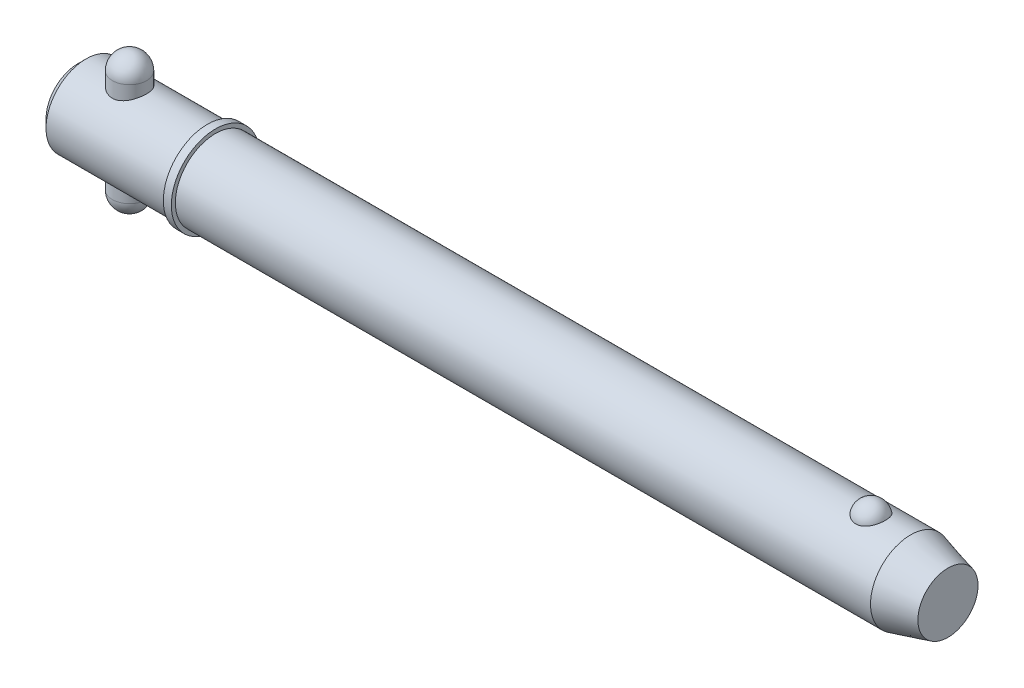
ISO-10303-21;
HEADER;
FILE_DESCRIPTION(('STEP AP214'),'2;1');
FILE_NAME('part.step','',(''),(''),'','','');
FILE_SCHEMA(('AUTOMOTIVE_DESIGN { 1 0 10303 214 1 1 1 1 }'));
ENDSEC;
DATA;
#1=APPLICATION_CONTEXT('core data for automotive mechanical design processes');
#2=APPLICATION_PROTOCOL_DEFINITION('international standard','automotive_design',2000,#1);
#3=PRODUCT_CONTEXT('',#1,'mechanical');
#4=PRODUCT('Part','Part','',(#3));
#5=PRODUCT_RELATED_PRODUCT_CATEGORY('part','',(#4));
#6=PRODUCT_DEFINITION_FORMATION('','',#4);
#7=PRODUCT_DEFINITION_CONTEXT('part definition',#1,'design');
#8=PRODUCT_DEFINITION('design','',#6,#7);
#9=PRODUCT_DEFINITION_SHAPE('','',#8);
#10=(LENGTH_UNIT() NAMED_UNIT(*) SI_UNIT(.MILLI.,.METRE.));
#11=(NAMED_UNIT(*) PLANE_ANGLE_UNIT() SI_UNIT($,.RADIAN.));
#12=(NAMED_UNIT(*) SI_UNIT($,.STERADIAN.) SOLID_ANGLE_UNIT());
#13=UNCERTAINTY_MEASURE_WITH_UNIT(LENGTH_MEASURE(1.E-05),#10,'distance_accuracy_value','');
#14=(GEOMETRIC_REPRESENTATION_CONTEXT(3) GLOBAL_UNCERTAINTY_ASSIGNED_CONTEXT((#13)) GLOBAL_UNIT_ASSIGNED_CONTEXT((#10,
#11,#12)) REPRESENTATION_CONTEXT('',''));
#15=CARTESIAN_POINT('',(0.,0.,0.));
#16=DIRECTION('',(0.,0.,1.));
#17=DIRECTION('',(1.,0.,0.));
#18=AXIS2_PLACEMENT_3D('',#15,#16,#17);
#19=CARTESIAN_POINT('',(14.28,19.05,0.));
#20=DIRECTION('',(0.,-1.,0.));
#21=DIRECTION('',(0.,0.,-1.));
#22=AXIS2_PLACEMENT_3D('',#19,#20,#21);
#23=CYLINDRICAL_SURFACE('',#22,4.76);
#24=CARTESIAN_POINT('',(14.28,-14.29,0.));
#25=DIRECTION('',(0.,-1.,0.));
#26=DIRECTION('',(0.,0.,-1.));
#27=AXIS2_PLACEMENT_3D('',#24,#25,#26);
#28=CIRCLE('',#27,4.76);
#29=CARTESIAN_POINT('',(14.28,-14.29,-4.76));
#30=VERTEX_POINT('',#29);
#31=EDGE_CURVE('P0_E10',#30,#30,#28,.F.);
#32=CARTESIAN_POINT('',(14.28,14.29,0.));
#33=DIRECTION('',(0.,-1.,0.));
#34=DIRECTION('',(0.,0.,-1.));
#35=AXIS2_PLACEMENT_3D('',#32,#33,#34);
#36=CIRCLE('',#35,4.76);
#37=CARTESIAN_POINT('',(14.28,14.29,-4.76));
#38=VERTEX_POINT('',#37);
#39=EDGE_CURVE('P0_E21',#38,#38,#36,.T.);
#40=CARTESIAN_POINT('',(14.28,-14.29,-4.76));
#41=CARTESIAN_POINT('',(14.28,-13.9922916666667,-4.76));
#42=CARTESIAN_POINT('',(14.28,-13.6945833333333,-4.76));
#43=CARTESIAN_POINT('',(14.28,-13.0991666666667,-4.76));
#44=CARTESIAN_POINT('',(14.28,-12.8014583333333,-4.76));
#45=CARTESIAN_POINT('',(14.28,-12.2060416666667,-4.76));
#46=CARTESIAN_POINT('',(14.28,-11.9083333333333,-4.76));
#47=CARTESIAN_POINT('',(14.28,-11.3129166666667,-4.76));
#48=CARTESIAN_POINT('',(14.28,-11.0152083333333,-4.76));
#49=CARTESIAN_POINT('',(14.28,-10.4197916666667,-4.76));
#50=CARTESIAN_POINT('',(14.28,-10.1220833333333,-4.76));
#51=CARTESIAN_POINT('',(14.28,-9.52666666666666,-4.76));
#52=CARTESIAN_POINT('',(14.28,-9.22895833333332,-4.76));
#53=CARTESIAN_POINT('',(14.28,-8.63354166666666,-4.76));
#54=CARTESIAN_POINT('',(14.28,-8.33583333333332,-4.76));
#55=CARTESIAN_POINT('',(14.28,-7.74041666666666,-4.76));
#56=CARTESIAN_POINT('',(14.28,-7.44270833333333,-4.76));
#57=CARTESIAN_POINT('',(14.28,-6.84729166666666,-4.76));
#58=CARTESIAN_POINT('',(14.28,-6.54958333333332,-4.76));
#59=CARTESIAN_POINT('',(14.28,-5.95416666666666,-4.76));
#60=CARTESIAN_POINT('',(14.28,-5.65645833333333,-4.76));
#61=CARTESIAN_POINT('',(14.28,-5.06104166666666,-4.76));
#62=CARTESIAN_POINT('',(14.28,-4.76333333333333,-4.76));
#63=CARTESIAN_POINT('',(14.28,-4.16791666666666,-4.76));
#64=CARTESIAN_POINT('',(14.28,-3.87020833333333,-4.76));
#65=CARTESIAN_POINT('',(14.28,-3.27479166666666,-4.76));
#66=CARTESIAN_POINT('',(14.28,-2.97708333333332,-4.76));
#67=CARTESIAN_POINT('',(14.28,-2.38166666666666,-4.76));
#68=CARTESIAN_POINT('',(14.28,-2.08395833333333,-4.76));
#69=CARTESIAN_POINT('',(14.28,-1.48854166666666,-4.76));
#70=CARTESIAN_POINT('',(14.28,-1.19083333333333,-4.76));
#71=CARTESIAN_POINT('',(14.28,-0.595416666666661,-4.76));
#72=CARTESIAN_POINT('',(14.28,-0.297708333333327,-4.76));
#73=CARTESIAN_POINT('',(14.28,0.297708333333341,-4.76));
#74=CARTESIAN_POINT('',(14.28,0.595416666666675,-4.76));
#75=CARTESIAN_POINT('',(14.28,1.19083333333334,-4.76));
#76=CARTESIAN_POINT('',(14.28,1.48854166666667,-4.76));
#77=CARTESIAN_POINT('',(14.28,2.08395833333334,-4.76));
#78=CARTESIAN_POINT('',(14.28,2.38166666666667,-4.76));
#79=CARTESIAN_POINT('',(14.28,2.97708333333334,-4.76));
#80=CARTESIAN_POINT('',(14.28,3.27479166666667,-4.76));
#81=CARTESIAN_POINT('',(14.28,3.87020833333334,-4.76));
#82=CARTESIAN_POINT('',(14.28,4.16791666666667,-4.76));
#83=CARTESIAN_POINT('',(14.28,4.76333333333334,-4.76));
#84=CARTESIAN_POINT('',(14.28,5.06104166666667,-4.76));
#85=CARTESIAN_POINT('',(14.28,5.65645833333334,-4.76));
#86=CARTESIAN_POINT('',(14.28,5.95416666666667,-4.76));
#87=CARTESIAN_POINT('',(14.28,6.54958333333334,-4.76));
#88=CARTESIAN_POINT('',(14.28,6.84729166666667,-4.76));
#89=CARTESIAN_POINT('',(14.28,7.44270833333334,-4.76));
#90=CARTESIAN_POINT('',(14.28,7.74041666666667,-4.76));
#91=CARTESIAN_POINT('',(14.28,8.33583333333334,-4.76));
#92=CARTESIAN_POINT('',(14.28,8.63354166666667,-4.76));
#93=CARTESIAN_POINT('',(14.28,9.22895833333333,-4.76));
#94=CARTESIAN_POINT('',(14.28,9.52666666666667,-4.76));
#95=CARTESIAN_POINT('',(14.28,10.1220833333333,-4.76));
#96=CARTESIAN_POINT('',(14.28,10.4197916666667,-4.76));
#97=CARTESIAN_POINT('',(14.28,11.0152083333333,-4.76));
#98=CARTESIAN_POINT('',(14.28,11.3129166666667,-4.76));
#99=CARTESIAN_POINT('',(14.28,11.9083333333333,-4.76));
#100=CARTESIAN_POINT('',(14.28,12.2060416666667,-4.76));
#101=CARTESIAN_POINT('',(14.28,12.8014583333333,-4.76));
#102=CARTESIAN_POINT('',(14.28,13.0991666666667,-4.76));
#103=CARTESIAN_POINT('',(14.28,13.6945833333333,-4.76));
#104=CARTESIAN_POINT('',(14.28,13.9922916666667,-4.76));
#105=CARTESIAN_POINT('',(14.28,14.29,-4.76));
#106=B_SPLINE_CURVE_WITH_KNOTS('',3,(#40,#41,#42,#43,#44,#45,#46,#47,#48,#49,#50,#51,#52,#53,
#54,#55,#56,#57,#58,#59,#60,#61,#62,#63,#64,#65,#66,#67,#68,#69,#70,#71,#72,#73,#74,#75,#76,#77,
#78,#79,#80,#81,#82,#83,#84,#85,#86,#87,#88,#89,#90,#91,#92,#93,#94,#95,#96,#97,#98,#99,#100,
#101,#102,#103,#104,#105),.UNSPECIFIED.,.F.,.F.,(4,2,2,2,2,2,2,2,2,2,2,2,2,2,2,2,2,2,2,2,2,2,2,
2,2,2,2,2,2,2,2,2,4),(0.,0.893125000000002,1.78625,2.67937499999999,3.5725,4.465625,5.35875,
6.25187499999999,7.145,8.038125,8.93125,9.82437499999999,10.7175,11.610625,12.50375,13.396875,
14.29,15.183125,16.07625,16.969375,17.8625,18.755625,19.64875,20.541875,21.435,22.328125,
23.22125,24.114375,25.0075,25.900625,26.79375,27.686875,28.58),.UNSPECIFIED.);
#107=EDGE_CURVE('P0_BSEAM14',#30,#38,#106,.T.);
#108=ORIENTED_EDGE('',*,*,#31,.T.);
#109=ORIENTED_EDGE('',*,*,#39,.T.);
#110=ORIENTED_EDGE('',*,*,#107,.T.);
#111=ORIENTED_EDGE('',*,*,#107,.F.);
#112=EDGE_LOOP('',(#108,#110,#109,#111));
#113=FACE_BOUND('',#112,.T.);
#114=ADVANCED_FACE('P0_F14',(#113),#23,.T.);
#115=CARTESIAN_POINT('',(14.28,-14.29,0.));
#116=DIRECTION('',(0.,0.,1.));
#117=DIRECTION('',(1.,0.,0.));
#118=AXIS2_PLACEMENT_3D('',#115,#116,#117);
#119=SPHERICAL_SURFACE('',#118,4.76);
#120=CARTESIAN_POINT('',(14.28,-14.29,0.));
#121=DIRECTION('',(0.,-1.,0.));
#122=DIRECTION('',(0.,0.,-1.));
#123=AXIS2_PLACEMENT_3D('',#120,#121,#122);
#124=SPHERICAL_SURFACE('',#123,4.76);
#125=ORIENTED_EDGE('',*,*,#31,.F.);
#126=EDGE_LOOP('',(#125));
#127=FACE_BOUND('',#126,.T.);
#128=ADVANCED_FACE('P0_F29',(#127),#124,.T.);
#129=CARTESIAN_POINT('',(14.28,14.29,0.));
#130=DIRECTION('',(0.,0.,1.));
#131=DIRECTION('',(1.,0.,0.));
#132=AXIS2_PLACEMENT_3D('',#129,#130,#131);
#133=SPHERICAL_SURFACE('',#132,4.76);
#134=CARTESIAN_POINT('',(14.28,14.29,0.));
#135=DIRECTION('',(0.,-1.,0.));
#136=DIRECTION('',(0.,0.,-1.));
#137=AXIS2_PLACEMENT_3D('',#134,#135,#136);
#138=SPHERICAL_SURFACE('',#137,4.76);
#139=ORIENTED_EDGE('',*,*,#39,.F.);
#140=EDGE_LOOP('',(#139));
#141=FACE_BOUND('',#140,.T.);
#142=ADVANCED_FACE('P0_F16',(#141),#138,.T.);
#143=CLOSED_SHELL('',(#114,#128,#142));
#144=MANIFOLD_SOLID_BREP('P0_B1',#143);
#145=CARTESIAN_POINT('',(0.,0.,0.));
#146=DIRECTION('',(1.,0.,0.));
#147=DIRECTION('',(0.,0.,-1.));
#148=AXIS2_PLACEMENT_3D('',#145,#146,#147);
#149=CYLINDRICAL_SURFACE('',#148,11.115);
#150=CARTESIAN_POINT('',(230.929563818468,0.,0.));
#151=DIRECTION('',(1.,0.,0.));
#152=DIRECTION('',(0.,0.,-1.));
#153=AXIS2_PLACEMENT_3D('',#150,#151,#152);
#154=CIRCLE('',#153,11.115);
#155=CARTESIAN_POINT('',(230.929563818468,0.,-11.115));
#156=VERTEX_POINT('',#155);
#157=EDGE_CURVE('P1_E81',#156,#156,#154,.T.);
#158=ORIENTED_EDGE('',*,*,#157,.F.);
#159=EDGE_LOOP('',(#158));
#160=FACE_BOUND('',#159,.T.);
#161=CARTESIAN_POINT('',(38.1,0.,0.));
#162=DIRECTION('',(1.,0.,0.));
#163=DIRECTION('',(0.,0.,-1.));
#164=AXIS2_PLACEMENT_3D('',#161,#162,#163);
#165=CIRCLE('',#164,11.115);
#166=CARTESIAN_POINT('',(38.1,0.,-11.115));
#167=VERTEX_POINT('',#166);
#168=EDGE_CURVE('P1_E85',#167,#167,#165,.T.);
#169=ORIENTED_EDGE('',*,*,#168,.T.);
#170=EDGE_LOOP('',(#169));
#171=FACE_BOUND('',#170,.T.);
#172=CARTESIAN_POINT('',(219.931068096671,10.3028087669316,4.17077409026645));
#173=CARTESIAN_POINT('',(219.714775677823,10.3028003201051,4.17078240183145));
#174=CARTESIAN_POINT('',(219.498548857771,10.3098895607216,4.15340593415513));
#175=CARTESIAN_POINT('',(219.072540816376,10.3373834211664,4.08449540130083));
#176=CARTESIAN_POINT('',(218.862757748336,10.3577841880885,4.0329712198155));
#177=CARTESIAN_POINT('',(218.455782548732,10.4095237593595,3.89746513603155));
#178=CARTESIAN_POINT('',(218.258572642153,10.4408466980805,3.81353029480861));
#179=CARTESIAN_POINT('',(217.881338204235,10.5110236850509,3.61560339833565));
#180=CARTESIAN_POINT('',(217.701317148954,10.5498792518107,3.50160528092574));
#181=CARTESIAN_POINT('',(217.357684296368,10.6322884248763,3.24292464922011));
#182=CARTESIAN_POINT('',(217.194686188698,10.6759443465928,3.09746040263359));
#183=CARTESIAN_POINT('',(216.894591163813,10.7625291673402,2.7817192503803));
#184=CARTESIAN_POINT('',(216.757499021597,10.8054579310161,2.61143778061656));
#185=CARTESIAN_POINT('',(216.506408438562,10.8881935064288,2.24226695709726));
#186=CARTESIAN_POINT('',(216.393710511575,10.9277761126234,2.04244123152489));
#187=CARTESIAN_POINT('',(216.201777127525,10.997484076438,1.62578254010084));
#188=CARTESIAN_POINT('',(216.122544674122,11.0276085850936,1.40894804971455));
#189=CARTESIAN_POINT('',(215.998303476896,11.0756732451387,0.961250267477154));
#190=CARTESIAN_POINT('',(215.953760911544,11.0934470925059,0.730239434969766));
#191=CARTESIAN_POINT('',(215.901569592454,11.1143331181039,0.263439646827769));
#192=CARTESIAN_POINT('',(215.893920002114,11.1174456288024,0.0276507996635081));
#193=CARTESIAN_POINT('',(215.91561056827,11.1087161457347,-0.440729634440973));
#194=CARTESIAN_POINT('',(215.944762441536,11.0969502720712,-0.6733313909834));
#195=CARTESIAN_POINT('',(216.039143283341,11.0597872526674,-1.12996621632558));
#196=CARTESIAN_POINT('',(216.104372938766,11.0343898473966,-1.35399912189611));
#197=CARTESIAN_POINT('',(216.26969844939,10.972515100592,-1.78750286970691));
#198=CARTESIAN_POINT('',(216.36983863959,10.9360236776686,-1.99695478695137));
#199=CARTESIAN_POINT('',(216.602940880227,10.8557595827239,-2.39520667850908));
#200=CARTESIAN_POINT('',(216.735905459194,10.8119863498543,-2.58400506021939));
#201=CARTESIAN_POINT('',(217.032407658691,10.7216733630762,-2.93635726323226));
#202=CARTESIAN_POINT('',(217.196056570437,10.675123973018,-3.09981510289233));
#203=CARTESIAN_POINT('',(217.549860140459,10.5846571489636,-3.39592247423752));
#204=CARTESIAN_POINT('',(217.740012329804,10.5407394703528,-3.52857487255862));
#205=CARTESIAN_POINT('',(218.13750141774,10.4616690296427,-3.75646057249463));
#206=CARTESIAN_POINT('',(218.34436705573,10.4263443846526,-3.85245432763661));
#207=CARTESIAN_POINT('',(218.772954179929,10.3675574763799,-4.00798747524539));
#208=CARTESIAN_POINT('',(218.994670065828,10.344090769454,-4.0675405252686));
#209=CARTESIAN_POINT('',(219.434669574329,10.3128282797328,-4.14614314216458));
#210=CARTESIAN_POINT('',(219.652565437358,10.3043040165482,-4.1670783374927));
#211=CARTESIAN_POINT('',(220.08894951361,10.3016771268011,-4.17357158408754));
#212=CARTESIAN_POINT('',(220.307437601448,10.3075716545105,-4.15913661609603));
#213=CARTESIAN_POINT('',(220.731744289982,10.3326686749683,-4.09636961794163));
#214=CARTESIAN_POINT('',(220.937745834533,10.3514555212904,-4.0490957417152));
#215=CARTESIAN_POINT('',(221.338576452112,10.399818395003,-3.92320197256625));
#216=CARTESIAN_POINT('',(221.5334046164,10.4293952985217,-3.84457953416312));
#217=CARTESIAN_POINT('',(221.911191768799,10.4969600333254,-3.65612410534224));
#218=CARTESIAN_POINT('',(222.093797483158,10.5351178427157,-3.54564545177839));
#219=CARTESIAN_POINT('',(222.438204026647,10.6154999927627,-3.29718036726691));
#220=CARTESIAN_POINT('',(222.600000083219,10.657725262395,-3.15918764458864));
#221=CARTESIAN_POINT('',(222.906959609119,10.744212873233,-2.85163580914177));
#222=CARTESIAN_POINT('',(223.050891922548,10.7884718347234,-2.68084605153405));
#223=CARTESIAN_POINT('',(223.309237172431,10.872374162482,-2.31721864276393));
#224=CARTESIAN_POINT('',(223.423644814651,10.9120167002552,-2.12437704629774));
#225=CARTESIAN_POINT('',(223.623873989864,10.9838919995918,-1.71516999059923));
#226=CARTESIAN_POINT('',(223.70866178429,11.0158465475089,-1.49824866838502));
#227=CARTESIAN_POINT('',(223.84268382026,11.0673523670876,-1.05228572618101));
#228=CARTESIAN_POINT('',(223.891917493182,11.086903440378,-0.823243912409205));
#229=CARTESIAN_POINT('',(223.953891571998,11.1116323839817,-0.359087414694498));
#230=CARTESIAN_POINT('',(223.966566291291,11.1167843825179,-0.12396256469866));
#231=CARTESIAN_POINT('',(223.954973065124,11.1121144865,0.345220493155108));
#232=CARTESIAN_POINT('',(223.930705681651,11.1022928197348,0.579278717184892));
#233=CARTESIAN_POINT('',(223.845907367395,11.0687504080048,1.03866534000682));
#234=CARTESIAN_POINT('',(223.785529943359,11.0450885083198,1.26402641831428));
#235=CARTESIAN_POINT('',(223.629853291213,10.9863185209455,1.70076772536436));
#236=CARTESIAN_POINT('',(223.534551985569,10.9512097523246,1.91214712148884));
#237=CARTESIAN_POINT('',(223.310397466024,10.8729733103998,2.316083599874));
#238=CARTESIAN_POINT('',(223.181380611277,10.8298068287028,2.50854240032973));
#239=CARTESIAN_POINT('',(222.892732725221,10.7401896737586,2.86808766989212));
#240=CARTESIAN_POINT('',(222.733102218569,10.6937390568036,3.03517457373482));
#241=CARTESIAN_POINT('',(222.387534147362,10.6029321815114,3.33857581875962));
#242=CARTESIAN_POINT('',(222.201708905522,10.5585680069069,3.47501541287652));
#243=CARTESIAN_POINT('',(221.807875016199,10.4769321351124,3.71390897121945));
#244=CARTESIAN_POINT('',(221.599863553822,10.439661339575,3.81635861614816));
#245=CARTESIAN_POINT('',(221.154066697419,10.3749407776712,3.98910631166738));
#246=CARTESIAN_POINT('',(220.915234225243,10.3482457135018,4.05700929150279));
#247=CARTESIAN_POINT('',(220.427925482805,10.312188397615,4.14782844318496));
#248=CARTESIAN_POINT('',(220.179453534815,10.3028184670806,4.17076454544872));
#249=CARTESIAN_POINT('',(219.931068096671,10.3028087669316,4.17077409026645));
#250=B_SPLINE_CURVE_WITH_KNOTS('',3,(#172,#173,#174,#175,#176,#177,#178,#179,#180,#181,#182,
#183,#184,#185,#186,#187,#188,#189,#190,#191,#192,#193,#194,#195,#196,#197,#198,#199,#200,#201,
#202,#203,#204,#205,#206,#207,#208,#209,#210,#211,#212,#213,#214,#215,#216,#217,#218,#219,#220,
#221,#222,#223,#224,#225,#226,#227,#228,#229,#230,#231,#232,#233,#234,#235,#236,#237,#238,#239,
#240,#241,#242,#243,#244,#245,#246,#247,#248,#249),.UNSPECIFIED.,.T.,.F.,(4,2,2,2,2,2,2,2,2,2,2,
2,2,2,2,2,2,2,2,2,2,2,2,2,2,2,2,2,2,2,2,2,2,2,2,2,2,2,4),(0.,0.64796614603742,1.29574482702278,
1.94258643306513,2.58955857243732,3.25496465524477,3.92049326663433,4.61566368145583,
5.31089647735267,6.01531821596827,6.71972398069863,7.42054043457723,8.12137023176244,
8.82309331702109,9.52487047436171,10.2292439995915,10.9335519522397,11.6223330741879,
12.3108558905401,12.9647664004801,13.6185478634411,14.252184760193,14.8858731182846,
15.5334360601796,16.1811472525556,16.8611459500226,17.5412664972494,18.2431855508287,
18.9451158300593,19.6483065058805,20.3514864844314,21.0516982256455,21.7519516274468,
22.4556690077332,23.1593743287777,23.860149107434,24.5610129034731,25.3054529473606,
26.049562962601),.UNSPECIFIED.);
#251=CARTESIAN_POINT('',(219.931068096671,10.3028087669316,4.17077409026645));
#252=VERTEX_POINT('',#251);
#253=EDGE_CURVE('P1_E35',#252,#252,#250,.T.);
#254=ORIENTED_EDGE('',*,*,#253,.T.);
#255=EDGE_LOOP('',(#254));
#256=FACE_BOUND('',#255,.T.);
#257=ADVANCED_FACE('P1_F13',(#160,#171,#256),#149,.T.);
#258=CARTESIAN_POINT('',(0.,0.,0.));
#259=DIRECTION('',(-1.,0.,0.));
#260=DIRECTION('',(0.,0.,1.));
#261=AXIS2_PLACEMENT_3D('',#258,#259,#260);
#262=PLANE('',#261);
#263=CARTESIAN_POINT('',(0.,0.,0.));
#264=DIRECTION('',(1.,0.,0.));
#265=DIRECTION('',(0.,0.,-1.));
#266=AXIS2_PLACEMENT_3D('',#263,#264,#265);
#267=CIRCLE('',#266,8.892);
#268=CARTESIAN_POINT('',(0.,0.,-8.892));
#269=VERTEX_POINT('',#268);
#270=EDGE_CURVE('P1_E9',#269,#269,#267,.T.);
#271=ORIENTED_EDGE('',*,*,#270,.F.);
#272=EDGE_LOOP('',(#271));
#273=FACE_BOUND('',#272,.T.);
#274=ADVANCED_FACE('P1_F15',(#273),#262,.T.);
#275=CARTESIAN_POINT('',(2.22299999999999,0.,0.));
#276=DIRECTION('',(1.,0.,0.));
#277=DIRECTION('',(0.,0.,-1.));
#278=AXIS2_PLACEMENT_3D('',#275,#276,#277);
#279=CONICAL_SURFACE('',#278,11.115,0.78539816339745);
#280=ORIENTED_EDGE('',*,*,#270,.T.);
#281=EDGE_LOOP('',(#280));
#282=FACE_BOUND('',#281,.T.);
#283=CARTESIAN_POINT('',(2.22299999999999,0.,0.));
#284=DIRECTION('',(1.,0.,0.));
#285=DIRECTION('',(0.,0.,-1.));
#286=AXIS2_PLACEMENT_3D('',#283,#284,#285);
#287=CIRCLE('',#286,11.115);
#288=CARTESIAN_POINT('',(2.22299999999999,0.,-11.115));
#289=VERTEX_POINT('',#288);
#290=EDGE_CURVE('P1_E26',#289,#289,#287,.T.);
#291=ORIENTED_EDGE('',*,*,#290,.F.);
#292=EDGE_LOOP('',(#291));
#293=FACE_BOUND('',#292,.T.);
#294=ADVANCED_FACE('P1_F77',(#282,#293),#279,.T.);
#295=CARTESIAN_POINT('',(0.,0.,0.));
#296=DIRECTION('',(1.,0.,0.));
#297=DIRECTION('',(0.,0.,-1.));
#298=AXIS2_PLACEMENT_3D('',#295,#296,#297);
#299=CYLINDRICAL_SURFACE('',#298,11.115);
#300=CARTESIAN_POINT('',(14.28,-10.0441836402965,4.76));
#301=CARTESIAN_POINT('',(14.1533731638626,-10.0441846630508,4.75999904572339));
#302=CARTESIAN_POINT('',(14.0267055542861,-10.0465865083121,4.75493985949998));
#303=CARTESIAN_POINT('',(13.774298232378,-10.0561141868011,4.73475585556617));
#304=CARTESIAN_POINT('',(13.6485591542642,-10.0632429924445,4.71962470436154));
#305=CARTESIAN_POINT('',(13.3987500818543,-10.0819979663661,4.67942666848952));
#306=CARTESIAN_POINT('',(13.2746840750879,-10.0936334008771,4.65433930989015));
#307=CARTESIAN_POINT('',(13.0293244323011,-10.1210146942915,4.59449317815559));
#308=CARTESIAN_POINT('',(12.9080319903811,-10.1367622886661,4.55973032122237));
#309=CARTESIAN_POINT('',(12.669614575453,-10.1717810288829,4.48106435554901));
#310=CARTESIAN_POINT('',(12.5524727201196,-10.1910352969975,4.4372048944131));
#311=CARTESIAN_POINT('',(12.3224300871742,-10.2325403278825,4.34063417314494));
#312=CARTESIAN_POINT('',(12.2095309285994,-10.2547922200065,4.28791957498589));
#313=CARTESIAN_POINT('',(11.8782785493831,-10.3250879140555,4.11715127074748));
#314=CARTESIAN_POINT('',(11.6670799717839,-10.3767168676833,3.98637638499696));
#315=CARTESIAN_POINT('',(11.2564039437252,-10.4874309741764,3.68567149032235));
#316=CARTESIAN_POINT('',(11.0583793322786,-10.5467772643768,3.51386978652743));
#317=CARTESIAN_POINT('',(10.6927724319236,-10.6641377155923,3.13969960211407));
#318=CARTESIAN_POINT('',(10.5252022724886,-10.7221513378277,2.93731900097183));
#319=CARTESIAN_POINT('',(10.2965609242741,-10.8050020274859,2.60935726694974));
#320=CARTESIAN_POINT('',(10.2227768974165,-10.8324811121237,2.49310321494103));
#321=CARTESIAN_POINT('',(10.0853380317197,-10.884703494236,2.25418999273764));
#322=CARTESIAN_POINT('',(10.0216789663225,-10.9094479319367,2.13153352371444));
#323=CARTESIAN_POINT('',(9.90506238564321,-10.9554932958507,1.88060370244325));
#324=CARTESIAN_POINT('',(9.85210574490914,-10.9767939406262,1.7523298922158));
#325=CARTESIAN_POINT('',(9.75746464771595,-11.0153112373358,1.49115740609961));
#326=CARTESIAN_POINT('',(9.71577447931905,-11.0325299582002,1.35826111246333));
#327=CARTESIAN_POINT('',(9.64605475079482,-11.0615607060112,1.09614539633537));
#328=CARTESIAN_POINT('',(9.61740732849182,-11.0736151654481,0.96711700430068));
#329=CARTESIAN_POINT('',(9.57092026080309,-11.0932687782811,0.706847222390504));
#330=CARTESIAN_POINT('',(9.55307574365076,-11.1008699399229,0.575606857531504));
#331=CARTESIAN_POINT('',(9.52838640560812,-11.1114054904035,0.31192917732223));
#332=CARTESIAN_POINT('',(9.52153986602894,-11.114340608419,0.179492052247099));
#333=CARTESIAN_POINT('',(9.51892405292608,-11.1154607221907,-0.0855090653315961));
#334=CARTESIAN_POINT('',(9.52315432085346,-11.1136459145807,-0.218073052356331));
#335=CARTESIAN_POINT('',(9.542009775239,-11.1055891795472,-0.473709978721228));
#336=CARTESIAN_POINT('',(9.55594693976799,-11.099640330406,-0.596843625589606));
#337=CARTESIAN_POINT('',(9.59332832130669,-11.0837823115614,-0.841440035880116));
#338=CARTESIAN_POINT('',(9.61677567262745,-11.0738718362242,-0.962902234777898));
#339=CARTESIAN_POINT('',(9.67294089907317,-11.0503378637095,-1.20325684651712));
#340=CARTESIAN_POINT('',(9.70565569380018,-11.0367156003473,-1.32215009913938));
#341=CARTESIAN_POINT('',(9.78005008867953,-11.0060908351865,-1.55666640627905));
#342=CARTESIAN_POINT('',(9.82173311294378,-10.9890870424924,-1.67228819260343));
#343=CARTESIAN_POINT('',(9.96110379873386,-10.9330280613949,-2.01656166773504));
#344=CARTESIAN_POINT('',(10.0722987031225,-10.8892801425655,-2.23915547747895));
#345=CARTESIAN_POINT('',(10.3268588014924,-10.7934745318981,-2.66299199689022));
#346=CARTESIAN_POINT('',(10.4702355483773,-10.7414138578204,-2.86422700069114));
#347=CARTESIAN_POINT('',(10.7973904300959,-10.6296201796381,-3.25557775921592));
#348=CARTESIAN_POINT('',(10.9833705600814,-10.569604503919,-3.443774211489));
#349=CARTESIAN_POINT('',(11.3844486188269,-10.4514707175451,-3.78722133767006));
#350=CARTESIAN_POINT('',(11.5995590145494,-10.3933534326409,-3.94245783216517));
#351=CARTESIAN_POINT('',(11.9444340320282,-10.311516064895,-4.14990014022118));
#352=CARTESIAN_POINT('',(12.0654579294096,-10.2847012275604,-4.21573894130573));
#353=CARTESIAN_POINT('',(12.3132718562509,-10.2342051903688,-4.33688518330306));
#354=CARTESIAN_POINT('',(12.4400593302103,-10.2105226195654,-4.39219723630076));
#355=CARTESIAN_POINT('',(12.6985418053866,-10.1671237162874,-4.49174500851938));
#356=CARTESIAN_POINT('',(12.8302359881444,-10.1474067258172,-4.53598256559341));
#357=CARTESIAN_POINT('',(13.0975061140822,-10.1126841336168,-4.61287629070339));
#358=CARTESIAN_POINT('',(13.233079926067,-10.0976759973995,-4.64553869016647));
#359=CARTESIAN_POINT('',(13.4978553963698,-10.0737863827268,-4.6971059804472));
#360=CARTESIAN_POINT('',(13.6268754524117,-10.0645618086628,-4.716785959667));
#361=CARTESIAN_POINT('',(13.8862990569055,-10.051062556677,-4.74548419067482));
#362=CARTESIAN_POINT('',(14.0167019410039,-10.0467856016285,-4.75450734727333));
#363=CARTESIAN_POINT('',(14.277859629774,-10.0433352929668,-4.76179143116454));
#364=CARTESIAN_POINT('',(14.4086143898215,-10.0441613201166,-4.76005366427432));
#365=CARTESIAN_POINT('',(14.6694025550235,-10.0508838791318,-4.74584231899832));
#366=CARTESIAN_POINT('',(14.7994359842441,-10.0567802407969,-4.73336910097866));
#367=CARTESIAN_POINT('',(15.0487369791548,-10.0728449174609,-4.69907984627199));
#368=CARTESIAN_POINT('',(15.1681238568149,-10.0826872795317,-4.67797462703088));
#369=CARTESIAN_POINT('',(15.4045894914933,-10.1062580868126,-4.62682977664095));
#370=CARTESIAN_POINT('',(15.5216674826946,-10.1199877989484,-4.59678723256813));
#371=CARTESIAN_POINT('',(15.868278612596,-10.1664161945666,-4.49365911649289));
#372=CARTESIAN_POINT('',(16.0933756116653,-10.2043671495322,-4.40754694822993));
#373=CARTESIAN_POINT('',(16.5357981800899,-10.2919879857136,-4.19898201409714));
#374=CARTESIAN_POINT('',(16.7523611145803,-10.3420954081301,-4.07511281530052));
#375=CARTESIAN_POINT('',(17.1627188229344,-10.4477911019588,-3.7959429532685));
#376=CARTESIAN_POINT('',(17.3565033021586,-10.5033818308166,-3.64062816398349));
#377=CARTESIAN_POINT('',(17.7334034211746,-10.6196376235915,-3.28693729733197));
#378=CARTESIAN_POINT('',(17.9141276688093,-10.6803237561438,-3.08599175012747));
#379=CARTESIAN_POINT('',(18.1582189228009,-10.7666348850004,-2.76320365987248));
#380=CARTESIAN_POINT('',(18.2351223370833,-10.7946346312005,-2.65197124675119));
#381=CARTESIAN_POINT('',(18.3793967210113,-10.8483267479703,-2.42297927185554));
#382=CARTESIAN_POINT('',(18.4467718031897,-10.87402011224,-2.30522255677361));
#383=CARTESIAN_POINT('',(18.5717669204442,-10.9225249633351,-2.06324665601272));
#384=CARTESIAN_POINT('',(18.6293326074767,-10.9453202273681,-1.93899615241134));
#385=CARTESIAN_POINT('',(18.73370006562,-10.9872100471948,-1.6855059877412));
#386=CARTESIAN_POINT('',(18.7805065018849,-11.0063062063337,-1.55626851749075));
#387=CARTESIAN_POINT('',(18.8628731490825,-11.0402419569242,-1.29375150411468));
#388=CARTESIAN_POINT('',(18.8984366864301,-11.0550828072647,-1.16047316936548));
#389=CARTESIAN_POINT('',(18.9579183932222,-11.0800638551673,-0.890912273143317));
#390=CARTESIAN_POINT('',(18.9818374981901,-11.0902044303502,-0.75462995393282));
#391=CARTESIAN_POINT('',(19.0164177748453,-11.104911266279,-0.490295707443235));
#392=CARTESIAN_POINT('',(19.027922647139,-11.1098318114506,-0.362373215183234));
#393=CARTESIAN_POINT('',(19.040554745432,-11.1152360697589,-0.105876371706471));
#394=CARTESIAN_POINT('',(19.0416784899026,-11.1157182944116,0.0226981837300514));
#395=CARTESIAN_POINT('',(19.0335275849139,-11.1122291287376,0.27938352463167));
#396=CARTESIAN_POINT('',(19.0242587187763,-11.1082602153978,0.407494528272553));
#397=CARTESIAN_POINT('',(18.9954320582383,-11.0959792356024,0.662388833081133));
#398=CARTESIAN_POINT('',(18.9758704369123,-11.0876655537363,0.789171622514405));
#399=CARTESIAN_POINT('',(18.9276379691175,-11.0673259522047,1.03545890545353));
#400=CARTESIAN_POINT('',(18.8993573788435,-11.0554596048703,1.15505309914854));
#401=CARTESIAN_POINT('',(18.8337694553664,-11.0282166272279,1.39134516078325));
#402=CARTESIAN_POINT('',(18.7964589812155,-11.0128387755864,1.5080420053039));
#403=CARTESIAN_POINT('',(18.671464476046,-10.9619666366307,1.85262797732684));
#404=CARTESIAN_POINT('',(18.5706772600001,-10.9217161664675,2.07521484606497));
#405=CARTESIAN_POINT('',(18.33202463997,-10.8301378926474,2.51061719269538));
#406=CARTESIAN_POINT('',(18.1926775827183,-10.7783885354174,2.72252375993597));
#407=CARTESIAN_POINT('',(17.8829747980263,-10.669863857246,3.12088015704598));
#408=CARTESIAN_POINT('',(17.7126068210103,-10.6130865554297,3.30731987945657));
#409=CARTESIAN_POINT('',(17.3310036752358,-10.495668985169,3.66358491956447));
#410=CARTESIAN_POINT('',(17.1177010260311,-10.4350471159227,3.83122543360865));
#411=CARTESIAN_POINT('',(16.7778915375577,-10.3495418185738,4.05420569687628));
#412=CARTESIAN_POINT('',(16.6612023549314,-10.3219229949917,4.12383380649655));
#413=CARTESIAN_POINT('',(16.4218466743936,-10.2693487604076,4.25306463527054));
#414=CARTESIAN_POINT('',(16.2991829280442,-10.2443921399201,4.31267191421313));
#415=CARTESIAN_POINT('',(16.0488008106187,-10.1979981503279,4.42126071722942));
#416=CARTESIAN_POINT('',(15.9210894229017,-10.1765561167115,4.47025635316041));
#417=CARTESIAN_POINT('',(15.6613937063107,-10.1379191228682,4.55720152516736));
#418=CARTESIAN_POINT('',(15.5294115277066,-10.1207220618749,4.59515652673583));
#419=CARTESIAN_POINT('',(15.2624981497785,-10.091252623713,4.65951684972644));
#420=CARTESIAN_POINT('',(15.1275757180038,-10.0789672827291,4.68595259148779));
#421=CARTESIAN_POINT('',(14.8556442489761,-10.0597530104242,4.72706206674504));
#422=CARTESIAN_POINT('',(14.7186368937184,-10.0528199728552,4.74174481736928));
#423=CARTESIAN_POINT('',(14.5310955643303,-10.047196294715,4.75363843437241));
#424=CARTESIAN_POINT('',(14.48091543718,-10.0460674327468,4.75602323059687));
#425=CARTESIAN_POINT('',(14.3804923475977,-10.044560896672,4.7592042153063));
#426=CARTESIAN_POINT('',(14.3302493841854,-10.0441832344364,4.76000037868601));
#427=CARTESIAN_POINT('',(14.28,-10.0441836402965,4.76));
#428=B_SPLINE_CURVE_WITH_KNOTS('',3,(#300,#301,#302,#303,#304,#305,#306,#307,#308,#309,#310,
#311,#312,#313,#314,#315,#316,#317,#318,#319,#320,#321,#322,#323,#324,#325,#326,#327,#328,#329,
#330,#331,#332,#333,#334,#335,#336,#337,#338,#339,#340,#341,#342,#343,#344,#345,#346,#347,#348,
#349,#350,#351,#352,#353,#354,#355,#356,#357,#358,#359,#360,#361,#362,#363,#364,#365,#366,#367,
#368,#369,#370,#371,#372,#373,#374,#375,#376,#377,#378,#379,#380,#381,#382,#383,#384,#385,#386,
#387,#388,#389,#390,#391,#392,#393,#394,#395,#396,#397,#398,#399,#400,#401,#402,#403,#404,#405,
#406,#407,#408,#409,#410,#411,#412,#413,#414,#415,#416,#417,#418,#419,#420,#421,#422,#423,#424,
#425,#426,#427),.UNSPECIFIED.,.T.,.F.,(4,2,2,2,2,2,2,2,2,2,2,2,2,2,2,2,2,2,2,2,2,2,2,2,2,2,2,2,
2,2,2,2,2,2,2,2,2,2,2,2,2,2,2,2,2,2,2,2,2,2,2,2,2,2,2,2,2,2,2,2,2,2,2,4),(0.,0.379828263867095,
0.759895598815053,1.14074858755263,1.52176256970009,1.90098898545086,2.28035867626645,
3.03818035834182,3.84125131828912,4.6446414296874,5.06541657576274,5.48601561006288,
5.90664899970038,6.3270687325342,6.72470503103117,7.12216187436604,7.51955659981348,
7.91693487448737,8.28868404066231,8.66055582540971,9.03230414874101,9.40419465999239,
10.1585834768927,10.9132435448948,11.7236471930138,12.5343987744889,12.9550196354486,
13.3754557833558,13.7958221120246,14.2159617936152,14.6079540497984,14.9997658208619,
15.3915300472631,15.7832811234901,16.1477615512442,16.512360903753,17.240999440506,
18.0012974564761,18.761937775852,19.5886929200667,20.0025782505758,20.4162843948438,
20.832212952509,21.2479608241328,21.6635855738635,22.0791769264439,22.4642880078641,
22.8495282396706,23.2345541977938,23.6197234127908,23.9896813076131,24.3597680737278,
25.099327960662,25.8726239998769,26.6462260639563,27.4759193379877,27.8914891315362,
28.3068693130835,28.7216936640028,29.1363123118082,29.5498292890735,29.9630287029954,
30.113753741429,30.2644811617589),.UNSPECIFIED.);
#429=CARTESIAN_POINT('',(14.28,-10.0441836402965,4.76));
#430=VERTEX_POINT('',#429);
#431=EDGE_CURVE('P1_E17',#430,#430,#428,.T.);
#432=ORIENTED_EDGE('',*,*,#431,.F.);
#433=EDGE_LOOP('',(#432));
#434=FACE_BOUND('',#433,.T.);
#435=CARTESIAN_POINT('',(14.28,10.0441836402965,4.76));
#436=CARTESIAN_POINT('',(14.4066268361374,10.0441846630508,4.75999904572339));
#437=CARTESIAN_POINT('',(14.5332944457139,10.0465865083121,4.75493985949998));
#438=CARTESIAN_POINT('',(14.785701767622,10.0561141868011,4.73475585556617));
#439=CARTESIAN_POINT('',(14.9114408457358,10.0632429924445,4.71962470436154));
#440=CARTESIAN_POINT('',(15.1612499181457,10.0819979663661,4.67942666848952));
#441=CARTESIAN_POINT('',(15.2853159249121,10.0936334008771,4.65433930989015));
#442=CARTESIAN_POINT('',(15.5306755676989,10.1210146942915,4.59449317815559));
#443=CARTESIAN_POINT('',(15.6519680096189,10.1367622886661,4.55973032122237));
#444=CARTESIAN_POINT('',(15.890385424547,10.1717810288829,4.48106435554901));
#445=CARTESIAN_POINT('',(16.0075272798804,10.1910352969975,4.4372048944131));
#446=CARTESIAN_POINT('',(16.2375699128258,10.2325403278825,4.34063417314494));
#447=CARTESIAN_POINT('',(16.3504690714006,10.2547922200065,4.28791957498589));
#448=CARTESIAN_POINT('',(16.6817214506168,10.3250879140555,4.11715127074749));
#449=CARTESIAN_POINT('',(16.8929200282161,10.3767168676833,3.98637638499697));
#450=CARTESIAN_POINT('',(17.3035960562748,10.4874309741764,3.68567149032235));
#451=CARTESIAN_POINT('',(17.5016206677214,10.5467772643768,3.51386978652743));
#452=CARTESIAN_POINT('',(17.8672275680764,10.6641377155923,3.13969960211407));
#453=CARTESIAN_POINT('',(18.0347977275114,10.7221513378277,2.93731900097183));
#454=CARTESIAN_POINT('',(18.2634390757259,10.8050020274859,2.60935726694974));
#455=CARTESIAN_POINT('',(18.3372231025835,10.8324811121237,2.49310321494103));
#456=CARTESIAN_POINT('',(18.4746619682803,10.884703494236,2.25418999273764));
#457=CARTESIAN_POINT('',(18.5383210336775,10.9094479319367,2.13153352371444));
#458=CARTESIAN_POINT('',(18.6549376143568,10.9554932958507,1.88060370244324));
#459=CARTESIAN_POINT('',(18.7078942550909,10.9767939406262,1.75232989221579));
#460=CARTESIAN_POINT('',(18.8025353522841,11.0153112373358,1.4911574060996));
#461=CARTESIAN_POINT('',(18.844225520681,11.0325299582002,1.35826111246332));
#462=CARTESIAN_POINT('',(18.9139452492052,11.0615607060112,1.09614539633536));
#463=CARTESIAN_POINT('',(18.9425926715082,11.0736151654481,0.967117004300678));
#464=CARTESIAN_POINT('',(18.9890797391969,11.0932687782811,0.706847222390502));
#465=CARTESIAN_POINT('',(19.0069242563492,11.1008699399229,0.575606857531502));
#466=CARTESIAN_POINT('',(19.0316135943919,11.1114054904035,0.311929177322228));
#467=CARTESIAN_POINT('',(19.0384601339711,11.114340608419,0.179492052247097));
#468=CARTESIAN_POINT('',(19.0410759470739,11.1154607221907,-0.0855090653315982));
#469=CARTESIAN_POINT('',(19.0368456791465,11.1136459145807,-0.218073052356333));
#470=CARTESIAN_POINT('',(19.017990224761,11.1055891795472,-0.47370997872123));
#471=CARTESIAN_POINT('',(19.004053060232,11.099640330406,-0.596843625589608));
#472=CARTESIAN_POINT('',(18.9666716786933,11.0837823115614,-0.841440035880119));
#473=CARTESIAN_POINT('',(18.9432243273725,11.0738718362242,-0.9629022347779));
#474=CARTESIAN_POINT('',(18.8870591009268,11.0503378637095,-1.20325684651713));
#475=CARTESIAN_POINT('',(18.8543443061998,11.0367156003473,-1.32215009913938));
#476=CARTESIAN_POINT('',(18.7799499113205,11.0060908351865,-1.55666640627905));
#477=CARTESIAN_POINT('',(18.7382668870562,10.9890870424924,-1.67228819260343));
#478=CARTESIAN_POINT('',(18.5988962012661,10.9330280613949,-2.01656166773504));
#479=CARTESIAN_POINT('',(18.4877012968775,10.8892801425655,-2.23915547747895));
#480=CARTESIAN_POINT('',(18.2331411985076,10.7934745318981,-2.66299199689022));
#481=CARTESIAN_POINT('',(18.0897644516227,10.7414138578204,-2.86422700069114));
#482=CARTESIAN_POINT('',(17.7626095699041,10.6296201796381,-3.25557775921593));
#483=CARTESIAN_POINT('',(17.5766294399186,10.569604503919,-3.443774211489));
#484=CARTESIAN_POINT('',(17.1755513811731,10.4514707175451,-3.78722133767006));
#485=CARTESIAN_POINT('',(16.9604409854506,10.3933534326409,-3.94245783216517));
#486=CARTESIAN_POINT('',(16.6155659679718,10.311516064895,-4.14990014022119));
#487=CARTESIAN_POINT('',(16.4945420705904,10.2847012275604,-4.21573894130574));
#488=CARTESIAN_POINT('',(16.2467281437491,10.2342051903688,-4.33688518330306));
#489=CARTESIAN_POINT('',(16.1199406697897,10.2105226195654,-4.39219723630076));
#490=CARTESIAN_POINT('',(15.8614581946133,10.1671237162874,-4.49174500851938));
#491=CARTESIAN_POINT('',(15.7297640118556,10.1474067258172,-4.53598256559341));
#492=CARTESIAN_POINT('',(15.4624938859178,10.1126841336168,-4.61287629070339));
#493=CARTESIAN_POINT('',(15.326920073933,10.0976759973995,-4.64553869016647));
#494=CARTESIAN_POINT('',(15.0621446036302,10.0737863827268,-4.6971059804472));
#495=CARTESIAN_POINT('',(14.9331245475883,10.0645618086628,-4.716785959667));
#496=CARTESIAN_POINT('',(14.6737009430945,10.051062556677,-4.74548419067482));
#497=CARTESIAN_POINT('',(14.543298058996,10.0467856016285,-4.75450734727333));
#498=CARTESIAN_POINT('',(14.2821403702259,10.0433352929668,-4.76179143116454));
#499=CARTESIAN_POINT('',(14.1513856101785,10.0441613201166,-4.76005366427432));
#500=CARTESIAN_POINT('',(13.8905974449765,10.0508838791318,-4.74584231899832));
#501=CARTESIAN_POINT('',(13.7605640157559,10.0567802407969,-4.73336910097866));
#502=CARTESIAN_POINT('',(13.5112630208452,10.0728449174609,-4.69907984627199));
#503=CARTESIAN_POINT('',(13.3918761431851,10.0826872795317,-4.67797462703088));
#504=CARTESIAN_POINT('',(13.1554105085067,10.1062580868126,-4.62682977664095));
#505=CARTESIAN_POINT('',(13.0383325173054,10.1199877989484,-4.59678723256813));
#506=CARTESIAN_POINT('',(12.691721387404,10.1664161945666,-4.49365911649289));
#507=CARTESIAN_POINT('',(12.4666243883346,10.2043671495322,-4.40754694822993));
#508=CARTESIAN_POINT('',(12.0242018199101,10.2919879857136,-4.19898201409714));
#509=CARTESIAN_POINT('',(11.8076388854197,10.3420954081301,-4.07511281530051));
#510=CARTESIAN_POINT('',(11.3972811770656,10.4477911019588,-3.7959429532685));
#511=CARTESIAN_POINT('',(11.2034966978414,10.5033818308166,-3.64062816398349));
#512=CARTESIAN_POINT('',(10.8265965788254,10.6196376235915,-3.28693729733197));
#513=CARTESIAN_POINT('',(10.6458723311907,10.6803237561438,-3.08599175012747));
#514=CARTESIAN_POINT('',(10.4017810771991,10.7666348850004,-2.76320365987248));
#515=CARTESIAN_POINT('',(10.3248776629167,10.7946346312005,-2.65197124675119));
#516=CARTESIAN_POINT('',(10.1806032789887,10.8483267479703,-2.42297927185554));
#517=CARTESIAN_POINT('',(10.1132281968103,10.87402011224,-2.30522255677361));
#518=CARTESIAN_POINT('',(9.98823307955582,10.9225249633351,-2.06324665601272));
#519=CARTESIAN_POINT('',(9.93066739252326,10.9453202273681,-1.93899615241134));
#520=CARTESIAN_POINT('',(9.82629993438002,10.9872100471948,-1.6855059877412));
#521=CARTESIAN_POINT('',(9.77949349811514,11.0063062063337,-1.55626851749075));
#522=CARTESIAN_POINT('',(9.69712685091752,11.0402419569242,-1.29375150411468));
#523=CARTESIAN_POINT('',(9.66156331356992,11.0550828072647,-1.16047316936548));
#524=CARTESIAN_POINT('',(9.60208160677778,11.0800638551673,-0.890912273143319));
#525=CARTESIAN_POINT('',(9.57816250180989,11.0902044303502,-0.754629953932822));
#526=CARTESIAN_POINT('',(9.54358222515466,11.104911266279,-0.490295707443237));
#527=CARTESIAN_POINT('',(9.53207735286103,11.1098318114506,-0.362373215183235));
#528=CARTESIAN_POINT('',(9.51944525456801,11.1152360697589,-0.105876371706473));
#529=CARTESIAN_POINT('',(9.51832151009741,11.1157182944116,0.0226981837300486));
#530=CARTESIAN_POINT('',(9.52647241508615,11.1122291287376,0.279383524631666));
#531=CARTESIAN_POINT('',(9.53574128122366,11.1082602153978,0.407494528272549));
#532=CARTESIAN_POINT('',(9.5645679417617,11.0959792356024,0.662388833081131));
#533=CARTESIAN_POINT('',(9.58412956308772,11.0876655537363,0.789171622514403));
#534=CARTESIAN_POINT('',(9.63236203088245,11.0673259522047,1.03545890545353));
#535=CARTESIAN_POINT('',(9.66064262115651,11.0554596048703,1.15505309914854));
#536=CARTESIAN_POINT('',(9.72623054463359,11.0282166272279,1.39134516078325));
#537=CARTESIAN_POINT('',(9.76354101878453,11.0128387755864,1.5080420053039));
#538=CARTESIAN_POINT('',(9.88853552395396,10.9619666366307,1.85262797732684));
#539=CARTESIAN_POINT('',(9.98932273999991,10.9217161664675,2.07521484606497));
#540=CARTESIAN_POINT('',(10.22797536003,10.8301378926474,2.51061719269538));
#541=CARTESIAN_POINT('',(10.3673224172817,10.7783885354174,2.72252375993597));
#542=CARTESIAN_POINT('',(10.6770252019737,10.669863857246,3.12088015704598));
#543=CARTESIAN_POINT('',(10.8473931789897,10.6130865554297,3.30731987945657));
#544=CARTESIAN_POINT('',(11.2289963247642,10.495668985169,3.66358491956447));
#545=CARTESIAN_POINT('',(11.4422989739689,10.4350471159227,3.83122543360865));
#546=CARTESIAN_POINT('',(11.7821084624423,10.3495418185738,4.05420569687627));
#547=CARTESIAN_POINT('',(11.8987976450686,10.3219229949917,4.12383380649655));
#548=CARTESIAN_POINT('',(12.1381533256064,10.2693487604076,4.25306463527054));
#549=CARTESIAN_POINT('',(12.2608170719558,10.2443921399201,4.31267191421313));
#550=CARTESIAN_POINT('',(12.5111991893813,10.1979981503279,4.42126071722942));
#551=CARTESIAN_POINT('',(12.6389105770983,10.1765561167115,4.47025635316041));
#552=CARTESIAN_POINT('',(12.8986062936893,10.1379191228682,4.55720152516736));
#553=CARTESIAN_POINT('',(13.0305884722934,10.1207220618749,4.59515652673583));
#554=CARTESIAN_POINT('',(13.2975018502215,10.091252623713,4.65951684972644));
#555=CARTESIAN_POINT('',(13.4324242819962,10.0789672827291,4.68595259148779));
#556=CARTESIAN_POINT('',(13.7043557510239,10.0597530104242,4.72706206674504));
#557=CARTESIAN_POINT('',(13.8413631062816,10.0528199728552,4.74174481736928));
#558=CARTESIAN_POINT('',(14.0289044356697,10.047196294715,4.75363843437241));
#559=CARTESIAN_POINT('',(14.07908456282,10.0460674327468,4.75602323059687));
#560=CARTESIAN_POINT('',(14.1795076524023,10.044560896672,4.7592042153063));
#561=CARTESIAN_POINT('',(14.2297506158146,10.0441832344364,4.76000037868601));
#562=CARTESIAN_POINT('',(14.28,10.0441836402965,4.76));
#563=B_SPLINE_CURVE_WITH_KNOTS('',3,(#435,#436,#437,#438,#439,#440,#441,#442,#443,#444,#445,
#446,#447,#448,#449,#450,#451,#452,#453,#454,#455,#456,#457,#458,#459,#460,#461,#462,#463,#464,
#465,#466,#467,#468,#469,#470,#471,#472,#473,#474,#475,#476,#477,#478,#479,#480,#481,#482,#483,
#484,#485,#486,#487,#488,#489,#490,#491,#492,#493,#494,#495,#496,#497,#498,#499,#500,#501,#502,
#503,#504,#505,#506,#507,#508,#509,#510,#511,#512,#513,#514,#515,#516,#517,#518,#519,#520,#521,
#522,#523,#524,#525,#526,#527,#528,#529,#530,#531,#532,#533,#534,#535,#536,#537,#538,#539,#540,
#541,#542,#543,#544,#545,#546,#547,#548,#549,#550,#551,#552,#553,#554,#555,#556,#557,#558,#559,
#560,#561,#562),.UNSPECIFIED.,.T.,.F.,(4,2,2,2,2,2,2,2,2,2,2,2,2,2,2,2,2,2,2,2,2,2,2,2,2,2,2,2,
2,2,2,2,2,2,2,2,2,2,2,2,2,2,2,2,2,2,2,2,2,2,2,2,2,2,2,2,2,2,2,2,2,2,2,4),(0.,0.379828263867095,
0.759895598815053,1.14074858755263,1.52176256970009,1.90098898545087,2.28035867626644,
3.03818035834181,3.84125131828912,4.6446414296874,5.06541657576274,5.48601561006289,
5.90664899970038,6.3270687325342,6.72470503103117,7.12216187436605,7.51955659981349,
7.91693487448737,8.28868404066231,8.66055582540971,9.03230414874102,9.4041946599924,
10.1585834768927,10.9132435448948,11.7236471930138,12.5343987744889,12.9550196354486,
13.3754557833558,13.7958221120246,14.2159617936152,14.6079540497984,14.9997658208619,
15.3915300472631,15.7832811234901,16.1477615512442,16.512360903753,17.240999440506,
18.0012974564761,18.761937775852,19.5886929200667,20.0025782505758,20.4162843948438,
20.832212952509,21.2479608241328,21.6635855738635,22.0791769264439,22.4642880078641,
22.8495282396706,23.2345541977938,23.6197234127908,23.9896813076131,24.3597680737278,
25.099327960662,25.8726239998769,26.6462260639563,27.4759193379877,27.8914891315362,
28.3068693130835,28.7216936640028,29.1363123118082,29.5498292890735,29.9630287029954,
30.113753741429,30.2644811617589),.UNSPECIFIED.);
#564=CARTESIAN_POINT('',(14.28,10.0441836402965,4.76));
#565=VERTEX_POINT('',#564);
#566=EDGE_CURVE('P1_E43',#565,#565,#563,.T.);
#567=ORIENTED_EDGE('',*,*,#566,.F.);
#568=EDGE_LOOP('',(#567));
#569=FACE_BOUND('',#568,.T.);
#570=ORIENTED_EDGE('',*,*,#290,.T.);
#571=EDGE_LOOP('',(#570));
#572=FACE_BOUND('',#571,.T.);
#573=CARTESIAN_POINT('',(35.877,0.,0.));
#574=DIRECTION('',(1.,0.,0.));
#575=DIRECTION('',(0.,0.,-1.));
#576=AXIS2_PLACEMENT_3D('',#573,#574,#575);
#577=CIRCLE('',#576,11.115);
#578=CARTESIAN_POINT('',(35.877,0.,-11.115));
#579=VERTEX_POINT('',#578);
#580=EDGE_CURVE('P1_E31',#579,#579,#577,.T.);
#581=ORIENTED_EDGE('',*,*,#580,.F.);
#582=EDGE_LOOP('',(#581));
#583=FACE_BOUND('',#582,.T.);
#584=ADVANCED_FACE('P1_F103',(#434,#569,#572,#583),#299,.T.);
#585=CARTESIAN_POINT('',(35.877,11.115,0.));
#586=DIRECTION('',(-1.,0.,0.));
#587=DIRECTION('',(0.,0.,1.));
#588=AXIS2_PLACEMENT_3D('',#585,#586,#587);
#589=PLANE('',#588);
#590=ORIENTED_EDGE('',*,*,#580,.T.);
#591=EDGE_LOOP('',(#590));
#592=FACE_BOUND('',#591,.T.);
#593=CARTESIAN_POINT('',(35.877,0.,0.));
#594=DIRECTION('',(1.,0.,0.));
#595=DIRECTION('',(0.,0.,-1.));
#596=AXIS2_PLACEMENT_3D('',#593,#594,#595);
#597=CIRCLE('',#596,12.2265);
#598=CARTESIAN_POINT('',(35.877,0.,-12.2265));
#599=VERTEX_POINT('',#598);
#600=EDGE_CURVE('P1_E91',#599,#599,#597,.T.);
#601=ORIENTED_EDGE('',*,*,#600,.F.);
#602=EDGE_LOOP('',(#601));
#603=FACE_BOUND('',#602,.T.);
#604=ADVANCED_FACE('P1_F100',(#592,#603),#589,.T.);
#605=CARTESIAN_POINT('',(0.,0.,0.));
#606=DIRECTION('',(1.,0.,0.));
#607=DIRECTION('',(0.,0.,-1.));
#608=AXIS2_PLACEMENT_3D('',#605,#606,#607);
#609=CYLINDRICAL_SURFACE('',#608,12.2265);
#610=ORIENTED_EDGE('',*,*,#600,.T.);
#611=EDGE_LOOP('',(#610));
#612=FACE_BOUND('',#611,.T.);
#613=CARTESIAN_POINT('',(38.1,0.,0.));
#614=DIRECTION('',(1.,0.,0.));
#615=DIRECTION('',(0.,0.,-1.));
#616=AXIS2_PLACEMENT_3D('',#613,#614,#615);
#617=CIRCLE('',#616,12.2265);
#618=CARTESIAN_POINT('',(38.1,0.,-12.2265));
#619=VERTEX_POINT('',#618);
#620=EDGE_CURVE('P1_E88',#619,#619,#617,.T.);
#621=ORIENTED_EDGE('',*,*,#620,.F.);
#622=EDGE_LOOP('',(#621));
#623=FACE_BOUND('',#622,.T.);
#624=ADVANCED_FACE('P1_F68',(#612,#623),#609,.T.);
#625=CARTESIAN_POINT('',(38.1,12.2265,0.));
#626=DIRECTION('',(1.,0.,0.));
#627=DIRECTION('',(0.,0.,-1.));
#628=AXIS2_PLACEMENT_3D('',#625,#626,#627);
#629=PLANE('',#628);
#630=ORIENTED_EDGE('',*,*,#620,.T.);
#631=EDGE_LOOP('',(#630));
#632=FACE_BOUND('',#631,.T.);
#633=ORIENTED_EDGE('',*,*,#168,.F.);
#634=EDGE_LOOP('',(#633));
#635=FACE_BOUND('',#634,.T.);
#636=ADVANCED_FACE('P1_F62',(#632,#635),#629,.T.);
#637=CARTESIAN_POINT('',(241.3,0.,0.));
#638=DIRECTION('',(-1.,0.,0.));
#639=DIRECTION('',(0.,0.,1.));
#640=AXIS2_PLACEMENT_3D('',#637,#638,#639);
#641=CONICAL_SURFACE('',#640,8.33625000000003,0.26179938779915);
#642=ORIENTED_EDGE('',*,*,#157,.T.);
#643=EDGE_LOOP('',(#642));
#644=FACE_BOUND('',#643,.T.);
#645=CARTESIAN_POINT('',(241.3,0.,0.));
#646=DIRECTION('',(1.,0.,0.));
#647=DIRECTION('',(0.,0.,-1.));
#648=AXIS2_PLACEMENT_3D('',#645,#646,#647);
#649=CIRCLE('',#648,8.33625000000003);
#650=CARTESIAN_POINT('',(241.3,0.,-8.33625000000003));
#651=VERTEX_POINT('',#650);
#652=EDGE_CURVE('P1_E42',#651,#651,#649,.T.);
#653=ORIENTED_EDGE('',*,*,#652,.F.);
#654=EDGE_LOOP('',(#653));
#655=FACE_BOUND('',#654,.T.);
#656=ADVANCED_FACE('P1_F59',(#644,#655),#641,.T.);
#657=CARTESIAN_POINT('',(241.3,8.33625000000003,0.));
#658=DIRECTION('',(1.,0.,0.));
#659=DIRECTION('',(0.,0.,-1.));
#660=AXIS2_PLACEMENT_3D('',#657,#658,#659);
#661=PLANE('',#660);
#662=ORIENTED_EDGE('',*,*,#652,.T.);
#663=EDGE_LOOP('',(#662));
#664=FACE_BOUND('',#663,.T.);
#665=ADVANCED_FACE('P1_F55',(#664),#661,.T.);
#666=CARTESIAN_POINT('',(219.931068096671,10.0035,0.));
#667=DIRECTION('',(-1.,0.,0.));
#668=DIRECTION('',(0.,1.,0.));
#669=AXIS2_PLACEMENT_3D('',#666,#667,#668);
#670=SPHERICAL_SURFACE('',#669,4.18150000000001);
#671=ORIENTED_EDGE('',*,*,#253,.F.);
#672=EDGE_LOOP('',(#671));
#673=FACE_BOUND('',#672,.T.);
#674=ADVANCED_FACE('P1_F50',(#673),#670,.T.);
#675=CARTESIAN_POINT('',(14.28,-12.2265,0.));
#676=DIRECTION('',(0.,1.,0.));
#677=DIRECTION('',(0.,0.,1.));
#678=AXIS2_PLACEMENT_3D('',#675,#676,#677);
#679=CYLINDRICAL_SURFACE('',#678,4.76);
#680=ORIENTED_EDGE('',*,*,#431,.T.);
#681=EDGE_LOOP('',(#680));
#682=FACE_BOUND('',#681,.T.);
#683=ORIENTED_EDGE('',*,*,#566,.T.);
#684=EDGE_LOOP('',(#683));
#685=FACE_BOUND('',#684,.T.);
#686=ADVANCED_FACE('P1_F54',(#682,#685),#679,.F.);
#687=CLOSED_SHELL('',(#257,#274,#294,#584,#604,#624,#636,#656,#665,#674,#686));
#688=MANIFOLD_SOLID_BREP('P1_B1',#687);
#689=ADVANCED_BREP_SHAPE_REPRESENTATION('',(#18,#144,#688),#14);
#690=SHAPE_DEFINITION_REPRESENTATION(#9,#689);
ENDSEC;
END-ISO-10303-21;
